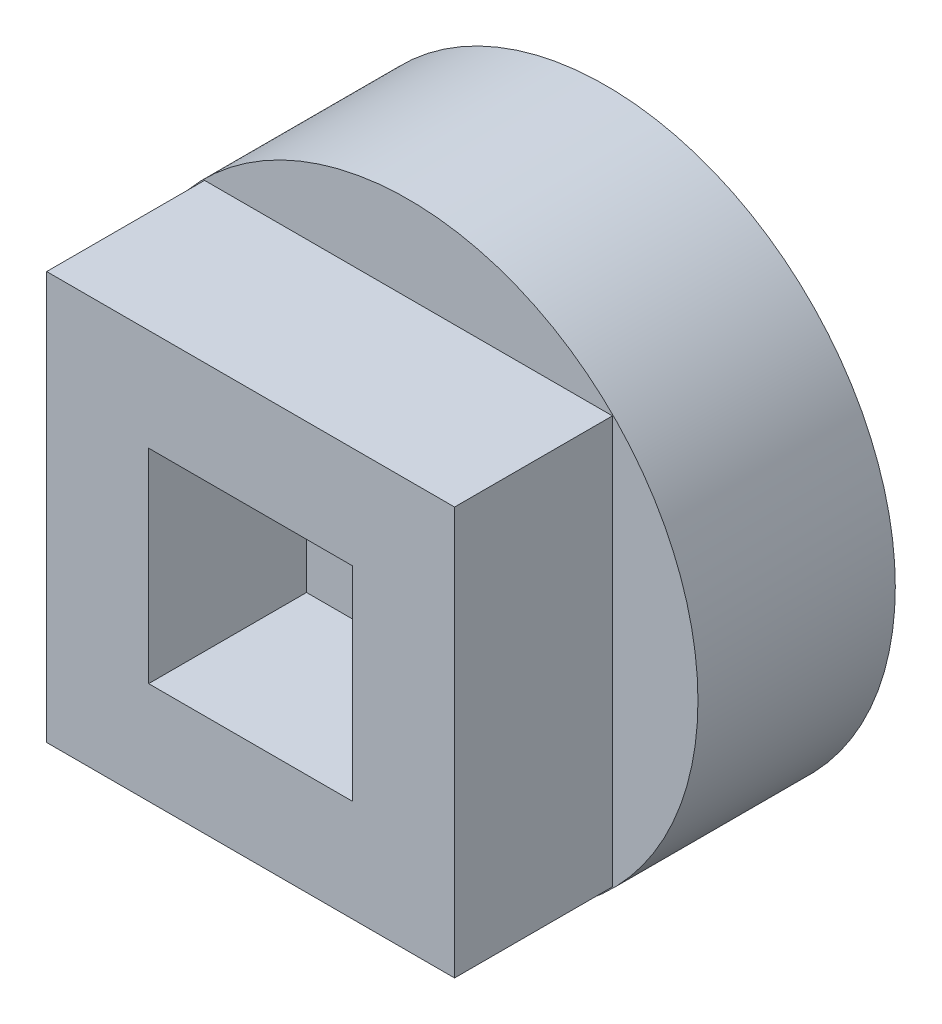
ISO-10303-21;
HEADER;
FILE_DESCRIPTION(('STEP AP214'),'2;1');
FILE_NAME('part.step','',(''),(''),'','','');
FILE_SCHEMA(('AUTOMOTIVE_DESIGN { 1 0 10303 214 1 1 1 1 }'));
ENDSEC;
DATA;
#1=APPLICATION_CONTEXT('core data for automotive mechanical design processes');
#2=APPLICATION_PROTOCOL_DEFINITION('international standard','automotive_design',2000,#1);
#3=PRODUCT_CONTEXT('',#1,'mechanical');
#4=PRODUCT('Part','Part','',(#3));
#5=PRODUCT_RELATED_PRODUCT_CATEGORY('part','',(#4));
#6=PRODUCT_DEFINITION_FORMATION('','',#4);
#7=PRODUCT_DEFINITION_CONTEXT('part definition',#1,'design');
#8=PRODUCT_DEFINITION('design','',#6,#7);
#9=PRODUCT_DEFINITION_SHAPE('','',#8);
#10=(LENGTH_UNIT() NAMED_UNIT(*) SI_UNIT(.MILLI.,.METRE.));
#11=(NAMED_UNIT(*) PLANE_ANGLE_UNIT() SI_UNIT($,.RADIAN.));
#12=(NAMED_UNIT(*) SI_UNIT($,.STERADIAN.) SOLID_ANGLE_UNIT());
#13=UNCERTAINTY_MEASURE_WITH_UNIT(LENGTH_MEASURE(1.E-05),#10,'distance_accuracy_value','');
#14=(GEOMETRIC_REPRESENTATION_CONTEXT(3) GLOBAL_UNCERTAINTY_ASSIGNED_CONTEXT((#13)) GLOBAL_UNIT_ASSIGNED_CONTEXT((#10,
#11,#12)) REPRESENTATION_CONTEXT('',''));
#15=CARTESIAN_POINT('',(0.,0.,0.));
#16=DIRECTION('',(0.,0.,1.));
#17=DIRECTION('',(1.,0.,0.));
#18=AXIS2_PLACEMENT_3D('',#15,#16,#17);
#19=CARTESIAN_POINT('',(0.,0.,7.50000000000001));
#20=DIRECTION('',(0.,0.,-1.));
#21=DIRECTION('',(-1.,0.,0.));
#22=AXIS2_PLACEMENT_3D('',#19,#20,#21);
#23=CYLINDRICAL_SURFACE('',#22,11.);
#24=CARTESIAN_POINT('',(0.,0.,7.50000000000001));
#25=DIRECTION('',(0.,0.,1.));
#26=DIRECTION('',(1.,0.,0.));
#27=AXIS2_PLACEMENT_3D('',#24,#25,#26);
#28=CIRCLE('',#27,11.);
#29=CARTESIAN_POINT('',(11.,0.,7.50000000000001));
#30=VERTEX_POINT('',#29);
#31=EDGE_CURVE('E13',#30,#30,#28,.T.);
#32=ORIENTED_EDGE('',*,*,#31,.F.);
#33=EDGE_LOOP('',(#32));
#34=FACE_BOUND('',#33,.T.);
#35=CARTESIAN_POINT('',(0.,0.,0.));
#36=DIRECTION('',(0.,0.,1.));
#37=DIRECTION('',(1.,0.,0.));
#38=AXIS2_PLACEMENT_3D('',#35,#36,#37);
#39=CIRCLE('',#38,11.);
#40=CARTESIAN_POINT('',(11.,0.,0.));
#41=VERTEX_POINT('',#40);
#42=EDGE_CURVE('E61',#41,#41,#39,.T.);
#43=ORIENTED_EDGE('',*,*,#42,.T.);
#44=EDGE_LOOP('',(#43));
#45=FACE_BOUND('',#44,.T.);
#46=ADVANCED_FACE('F58',(#34,#45),#23,.T.);
#47=CARTESIAN_POINT('',(0.,0.,7.50000000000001));
#48=DIRECTION('',(0.,0.,1.));
#49=DIRECTION('',(1.,0.,0.));
#50=AXIS2_PLACEMENT_3D('',#47,#48,#49);
#51=PLANE('',#50);
#52=DIRECTION('',(0.,-1.,0.));
#53=VECTOR('',#52,1.);
#54=CARTESIAN_POINT('',(-7.75,7.75,7.50000000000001));
#55=LINE('',#54,#53);
#56=CARTESIAN_POINT('',(-7.75,7.75,7.50000000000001));
#57=VERTEX_POINT('',#56);
#58=CARTESIAN_POINT('',(-7.75000000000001,-7.75,7.5));
#59=VERTEX_POINT('',#58);
#60=EDGE_CURVE('E81',#57,#59,#55,.T.);
#61=ORIENTED_EDGE('',*,*,#60,.F.);
#62=DIRECTION('',(-1.,0.,0.));
#63=VECTOR('',#62,1.);
#64=CARTESIAN_POINT('',(-7.75,7.75,7.50000000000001));
#65=LINE('',#64,#63);
#66=CARTESIAN_POINT('',(7.75,7.75,7.50000000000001));
#67=VERTEX_POINT('',#66);
#68=EDGE_CURVE('E172',#67,#57,#65,.T.);
#69=ORIENTED_EDGE('',*,*,#68,.F.);
#70=DIRECTION('',(0.,1.,0.));
#71=VECTOR('',#70,1.);
#72=CARTESIAN_POINT('',(7.75,7.75,7.50000000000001));
#73=LINE('',#72,#71);
#74=CARTESIAN_POINT('',(7.75000000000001,-7.75,7.50000000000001));
#75=VERTEX_POINT('',#74);
#76=EDGE_CURVE('E188',#75,#67,#73,.T.);
#77=ORIENTED_EDGE('',*,*,#76,.F.);
#78=DIRECTION('',(1.,0.,0.));
#79=VECTOR('',#78,1.);
#80=CARTESIAN_POINT('',(-7.75000000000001,-7.75,7.5));
#81=LINE('',#80,#79);
#82=EDGE_CURVE('E184',#59,#75,#81,.T.);
#83=ORIENTED_EDGE('',*,*,#82,.F.);
#84=EDGE_LOOP('',(#61,#69,#77,#83));
#85=FACE_BOUND('',#84,.T.);
#86=ORIENTED_EDGE('',*,*,#31,.T.);
#87=EDGE_LOOP('',(#86));
#88=FACE_BOUND('',#87,.T.);
#89=ADVANCED_FACE('F220',(#85,#88),#51,.T.);
#90=CARTESIAN_POINT('',(0.,0.,0.));
#91=DIRECTION('',(0.,0.,1.));
#92=DIRECTION('',(1.,0.,0.));
#93=AXIS2_PLACEMENT_3D('',#90,#91,#92);
#94=PLANE('',#93);
#95=ORIENTED_EDGE('',*,*,#42,.F.);
#96=EDGE_LOOP('',(#95));
#97=FACE_BOUND('',#96,.T.);
#98=ADVANCED_FACE('F217',(#97),#94,.F.);
#99=CARTESIAN_POINT('',(-7.75,7.75,13.5));
#100=DIRECTION('',(1.,0.,0.));
#101=DIRECTION('',(0.,0.,-1.));
#102=AXIS2_PLACEMENT_3D('',#99,#100,#101);
#103=PLANE('',#102);
#104=ORIENTED_EDGE('',*,*,#60,.T.);
#105=DIRECTION('',(0.,0.,-1.));
#106=VECTOR('',#105,1.);
#107=CARTESIAN_POINT('',(-7.75000000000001,-7.75000000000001,13.5));
#108=LINE('',#107,#106);
#109=CARTESIAN_POINT('',(-7.75000000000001,-7.75000000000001,13.5));
#110=VERTEX_POINT('',#109);
#111=EDGE_CURVE('E205',#110,#59,#108,.T.);
#112=ORIENTED_EDGE('',*,*,#111,.F.);
#113=DIRECTION('',(0.,-1.,0.));
#114=VECTOR('',#113,1.);
#115=CARTESIAN_POINT('',(-7.75,7.75,13.5));
#116=LINE('',#115,#114);
#117=CARTESIAN_POINT('',(-7.75,7.75,13.5));
#118=VERTEX_POINT('',#117);
#119=EDGE_CURVE('E167',#118,#110,#116,.T.);
#120=ORIENTED_EDGE('',*,*,#119,.F.);
#121=DIRECTION('',(0.,0.,-1.));
#122=VECTOR('',#121,1.);
#123=CARTESIAN_POINT('',(-7.75,7.75,13.5));
#124=LINE('',#123,#122);
#125=EDGE_CURVE('E181',#118,#57,#124,.T.);
#126=ORIENTED_EDGE('',*,*,#125,.T.);
#127=EDGE_LOOP('',(#104,#112,#120,#126));
#128=FACE_BOUND('',#127,.T.);
#129=ADVANCED_FACE('F219',(#128),#103,.F.);
#130=CARTESIAN_POINT('',(-7.75000000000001,-7.75000000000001,13.5));
#131=DIRECTION('',(0.,1.,0.));
#132=DIRECTION('',(-1.,0.,0.));
#133=AXIS2_PLACEMENT_3D('',#130,#131,#132);
#134=PLANE('',#133);
#135=ORIENTED_EDGE('',*,*,#82,.T.);
#136=DIRECTION('',(0.,0.,-1.));
#137=VECTOR('',#136,1.);
#138=CARTESIAN_POINT('',(7.75000000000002,-7.75000000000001,13.5));
#139=LINE('',#138,#137);
#140=CARTESIAN_POINT('',(7.75000000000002,-7.75000000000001,13.5));
#141=VERTEX_POINT('',#140);
#142=EDGE_CURVE('E201',#141,#75,#139,.T.);
#143=ORIENTED_EDGE('',*,*,#142,.F.);
#144=DIRECTION('',(1.,0.,0.));
#145=VECTOR('',#144,1.);
#146=CARTESIAN_POINT('',(-7.75000000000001,-7.75000000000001,13.5));
#147=LINE('',#146,#145);
#148=EDGE_CURVE('E171',#110,#141,#147,.T.);
#149=ORIENTED_EDGE('',*,*,#148,.F.);
#150=ORIENTED_EDGE('',*,*,#111,.T.);
#151=EDGE_LOOP('',(#135,#143,#149,#150));
#152=FACE_BOUND('',#151,.T.);
#153=ADVANCED_FACE('F225',(#152),#134,.F.);
#154=CARTESIAN_POINT('',(7.75,7.75,13.5));
#155=DIRECTION('',(-1.,0.,0.));
#156=DIRECTION('',(0.,-1.,0.));
#157=AXIS2_PLACEMENT_3D('',#154,#155,#156);
#158=PLANE('',#157);
#159=ORIENTED_EDGE('',*,*,#76,.T.);
#160=DIRECTION('',(0.,0.,-1.));
#161=VECTOR('',#160,1.);
#162=CARTESIAN_POINT('',(7.75,7.75,13.5));
#163=LINE('',#162,#161);
#164=CARTESIAN_POINT('',(7.75,7.75,13.5));
#165=VERTEX_POINT('',#164);
#166=EDGE_CURVE('E197',#165,#67,#163,.T.);
#167=ORIENTED_EDGE('',*,*,#166,.F.);
#168=DIRECTION('',(0.,1.,0.));
#169=VECTOR('',#168,1.);
#170=CARTESIAN_POINT('',(7.75,7.75,13.5));
#171=LINE('',#170,#169);
#172=EDGE_CURVE('E175',#141,#165,#171,.T.);
#173=ORIENTED_EDGE('',*,*,#172,.F.);
#174=ORIENTED_EDGE('',*,*,#142,.T.);
#175=EDGE_LOOP('',(#159,#167,#173,#174));
#176=FACE_BOUND('',#175,.T.);
#177=ADVANCED_FACE('F258',(#176),#158,.F.);
#178=CARTESIAN_POINT('',(-7.75,7.75,13.5));
#179=DIRECTION('',(0.,-1.,0.));
#180=DIRECTION('',(1.,0.,0.));
#181=AXIS2_PLACEMENT_3D('',#178,#179,#180);
#182=PLANE('',#181);
#183=ORIENTED_EDGE('',*,*,#68,.T.);
#184=ORIENTED_EDGE('',*,*,#125,.F.);
#185=DIRECTION('',(-1.,0.,0.));
#186=VECTOR('',#185,1.);
#187=CARTESIAN_POINT('',(-7.75,7.75,13.5));
#188=LINE('',#187,#186);
#189=EDGE_CURVE('E178',#165,#118,#188,.T.);
#190=ORIENTED_EDGE('',*,*,#189,.F.);
#191=ORIENTED_EDGE('',*,*,#166,.T.);
#192=EDGE_LOOP('',(#183,#184,#190,#191));
#193=FACE_BOUND('',#192,.T.);
#194=ADVANCED_FACE('F267',(#193),#182,.F.);
#195=CARTESIAN_POINT('',(0.,0.,13.5));
#196=DIRECTION('',(0.,0.,1.));
#197=DIRECTION('',(1.,0.,0.));
#198=AXIS2_PLACEMENT_3D('',#195,#196,#197);
#199=PLANE('',#198);
#200=DIRECTION('',(0.,-1.,0.));
#201=VECTOR('',#200,1.);
#202=CARTESIAN_POINT('',(-3.875,3.875,13.5));
#203=LINE('',#202,#201);
#204=CARTESIAN_POINT('',(-3.875,3.875,13.5));
#205=VERTEX_POINT('',#204);
#206=CARTESIAN_POINT('',(-3.87500000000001,-3.875,13.5));
#207=VERTEX_POINT('',#206);
#208=EDGE_CURVE('E73',#205,#207,#203,.T.);
#209=ORIENTED_EDGE('',*,*,#208,.F.);
#210=DIRECTION('',(-1.,0.,0.));
#211=VECTOR('',#210,1.);
#212=CARTESIAN_POINT('',(-3.875,3.875,13.5));
#213=LINE('',#212,#211);
#214=CARTESIAN_POINT('',(3.875,3.875,13.5));
#215=VERTEX_POINT('',#214);
#216=EDGE_CURVE('E148',#215,#205,#213,.T.);
#217=ORIENTED_EDGE('',*,*,#216,.F.);
#218=DIRECTION('',(0.,1.,0.));
#219=VECTOR('',#218,1.);
#220=CARTESIAN_POINT('',(3.875,3.875,13.5));
#221=LINE('',#220,#219);
#222=CARTESIAN_POINT('',(3.875,-3.875,13.5));
#223=VERTEX_POINT('',#222);
#224=EDGE_CURVE('E129',#223,#215,#221,.T.);
#225=ORIENTED_EDGE('',*,*,#224,.F.);
#226=DIRECTION('',(1.,0.,0.));
#227=VECTOR('',#226,1.);
#228=CARTESIAN_POINT('',(-3.87500000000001,-3.875,13.5));
#229=LINE('',#228,#227);
#230=EDGE_CURVE('E140',#207,#223,#229,.T.);
#231=ORIENTED_EDGE('',*,*,#230,.F.);
#232=EDGE_LOOP('',(#209,#217,#225,#231));
#233=FACE_BOUND('',#232,.T.);
#234=ORIENTED_EDGE('',*,*,#119,.T.);
#235=ORIENTED_EDGE('',*,*,#148,.T.);
#236=ORIENTED_EDGE('',*,*,#172,.T.);
#237=ORIENTED_EDGE('',*,*,#189,.T.);
#238=EDGE_LOOP('',(#234,#235,#236,#237));
#239=FACE_BOUND('',#238,.T.);
#240=ADVANCED_FACE('F145',(#233,#239),#199,.T.);
#241=CARTESIAN_POINT('',(-3.87500000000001,3.875,-3.46015510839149));
#242=DIRECTION('',(-1.,0.,0.));
#243=DIRECTION('',(0.,0.,1.));
#244=AXIS2_PLACEMENT_3D('',#241,#242,#243);
#245=PLANE('',#244);
#246=DIRECTION('',(0.,1.,0.));
#247=VECTOR('',#246,1.);
#248=CARTESIAN_POINT('',(-3.875,3.875,7.5));
#249=LINE('',#248,#247);
#250=CARTESIAN_POINT('',(-3.87500000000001,-3.875,7.50000000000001));
#251=VERTEX_POINT('',#250);
#252=CARTESIAN_POINT('',(-3.875,3.875,7.5));
#253=VERTEX_POINT('',#252);
#254=EDGE_CURVE('E166',#251,#253,#249,.T.);
#255=ORIENTED_EDGE('',*,*,#254,.T.);
#256=DIRECTION('',(0.,0.,1.));
#257=VECTOR('',#256,1.);
#258=CARTESIAN_POINT('',(-3.87500000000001,3.875,-3.46015510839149));
#259=LINE('',#258,#257);
#260=EDGE_CURVE('E156',#253,#205,#259,.T.);
#261=ORIENTED_EDGE('',*,*,#260,.T.);
#262=ORIENTED_EDGE('',*,*,#208,.T.);
#263=DIRECTION('',(0.,0.,1.));
#264=VECTOR('',#263,1.);
#265=CARTESIAN_POINT('',(-3.87500000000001,-3.875,-3.46015510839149));
#266=LINE('',#265,#264);
#267=EDGE_CURVE('E137',#251,#207,#266,.T.);
#268=ORIENTED_EDGE('',*,*,#267,.F.);
#269=EDGE_LOOP('',(#255,#261,#262,#268));
#270=FACE_BOUND('',#269,.T.);
#271=ADVANCED_FACE('F286',(#270),#245,.F.);
#272=CARTESIAN_POINT('',(-3.87500000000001,3.875,-3.46015510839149));
#273=DIRECTION('',(0.,1.,0.));
#274=DIRECTION('',(0.,0.,1.));
#275=AXIS2_PLACEMENT_3D('',#272,#273,#274);
#276=PLANE('',#275);
#277=DIRECTION('',(1.,0.,0.));
#278=VECTOR('',#277,1.);
#279=CARTESIAN_POINT('',(-3.875,3.875,7.5));
#280=LINE('',#279,#278);
#281=CARTESIAN_POINT('',(3.87500000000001,3.875,7.50000000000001));
#282=VERTEX_POINT('',#281);
#283=EDGE_CURVE('E390',#253,#282,#280,.T.);
#284=ORIENTED_EDGE('',*,*,#283,.T.);
#285=DIRECTION('',(0.,0.,1.));
#286=VECTOR('',#285,1.);
#287=CARTESIAN_POINT('',(3.875,3.875,-3.46015510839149));
#288=LINE('',#287,#286);
#289=EDGE_CURVE('E136',#282,#215,#288,.T.);
#290=ORIENTED_EDGE('',*,*,#289,.T.);
#291=ORIENTED_EDGE('',*,*,#216,.T.);
#292=ORIENTED_EDGE('',*,*,#260,.F.);
#293=EDGE_LOOP('',(#284,#290,#291,#292));
#294=FACE_BOUND('',#293,.T.);
#295=ADVANCED_FACE('F295',(#294),#276,.F.);
#296=CARTESIAN_POINT('',(3.875,3.875,-3.46015510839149));
#297=DIRECTION('',(1.,0.,0.));
#298=DIRECTION('',(0.,0.,-1.));
#299=AXIS2_PLACEMENT_3D('',#296,#297,#298);
#300=PLANE('',#299);
#301=DIRECTION('',(0.,-1.,0.));
#302=VECTOR('',#301,1.);
#303=CARTESIAN_POINT('',(3.87500000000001,3.875,7.50000000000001));
#304=LINE('',#303,#302);
#305=CARTESIAN_POINT('',(3.875,-3.875,7.50000000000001));
#306=VERTEX_POINT('',#305);
#307=EDGE_CURVE('E132',#282,#306,#304,.T.);
#308=ORIENTED_EDGE('',*,*,#307,.T.);
#309=DIRECTION('',(0.,0.,1.));
#310=VECTOR('',#309,1.);
#311=CARTESIAN_POINT('',(3.875,-3.875,-3.46015510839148));
#312=LINE('',#311,#310);
#313=EDGE_CURVE('E124',#306,#223,#312,.T.);
#314=ORIENTED_EDGE('',*,*,#313,.T.);
#315=ORIENTED_EDGE('',*,*,#224,.T.);
#316=ORIENTED_EDGE('',*,*,#289,.F.);
#317=EDGE_LOOP('',(#308,#314,#315,#316));
#318=FACE_BOUND('',#317,.T.);
#319=ADVANCED_FACE('F126',(#318),#300,.F.);
#320=CARTESIAN_POINT('',(-3.87500000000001,-3.875,-3.46015510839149));
#321=DIRECTION('',(0.,-1.,0.));
#322=DIRECTION('',(0.,0.,-1.));
#323=AXIS2_PLACEMENT_3D('',#320,#321,#322);
#324=PLANE('',#323);
#325=DIRECTION('',(-1.,0.,0.));
#326=VECTOR('',#325,1.);
#327=CARTESIAN_POINT('',(-3.87500000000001,-3.875,7.50000000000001));
#328=LINE('',#327,#326);
#329=EDGE_CURVE('E163',#306,#251,#328,.T.);
#330=ORIENTED_EDGE('',*,*,#329,.T.);
#331=ORIENTED_EDGE('',*,*,#267,.T.);
#332=ORIENTED_EDGE('',*,*,#230,.T.);
#333=ORIENTED_EDGE('',*,*,#313,.F.);
#334=EDGE_LOOP('',(#330,#331,#332,#333));
#335=FACE_BOUND('',#334,.T.);
#336=ADVANCED_FACE('F141',(#335),#324,.F.);
#337=CARTESIAN_POINT('',(0.,0.,7.50000000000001));
#338=DIRECTION('',(0.,0.,1.));
#339=DIRECTION('',(1.,0.,0.));
#340=AXIS2_PLACEMENT_3D('',#337,#338,#339);
#341=PLANE('',#340);
#342=ORIENTED_EDGE('',*,*,#254,.F.);
#343=ORIENTED_EDGE('',*,*,#329,.F.);
#344=ORIENTED_EDGE('',*,*,#307,.F.);
#345=ORIENTED_EDGE('',*,*,#283,.F.);
#346=EDGE_LOOP('',(#342,#343,#344,#345));
#347=FACE_BOUND('',#346,.T.);
#348=ADVANCED_FACE('F321',(#347),#341,.T.);
#349=CLOSED_SHELL('',(#46,#89,#98,#129,#153,#177,#194,#240,#271,#295,#319,#336,#348));
#350=MANIFOLD_SOLID_BREP('B2',#349);
#351=ADVANCED_BREP_SHAPE_REPRESENTATION('',(#18,#350),#14);
#352=SHAPE_DEFINITION_REPRESENTATION(#9,#351);
ENDSEC;
END-ISO-10303-21;
